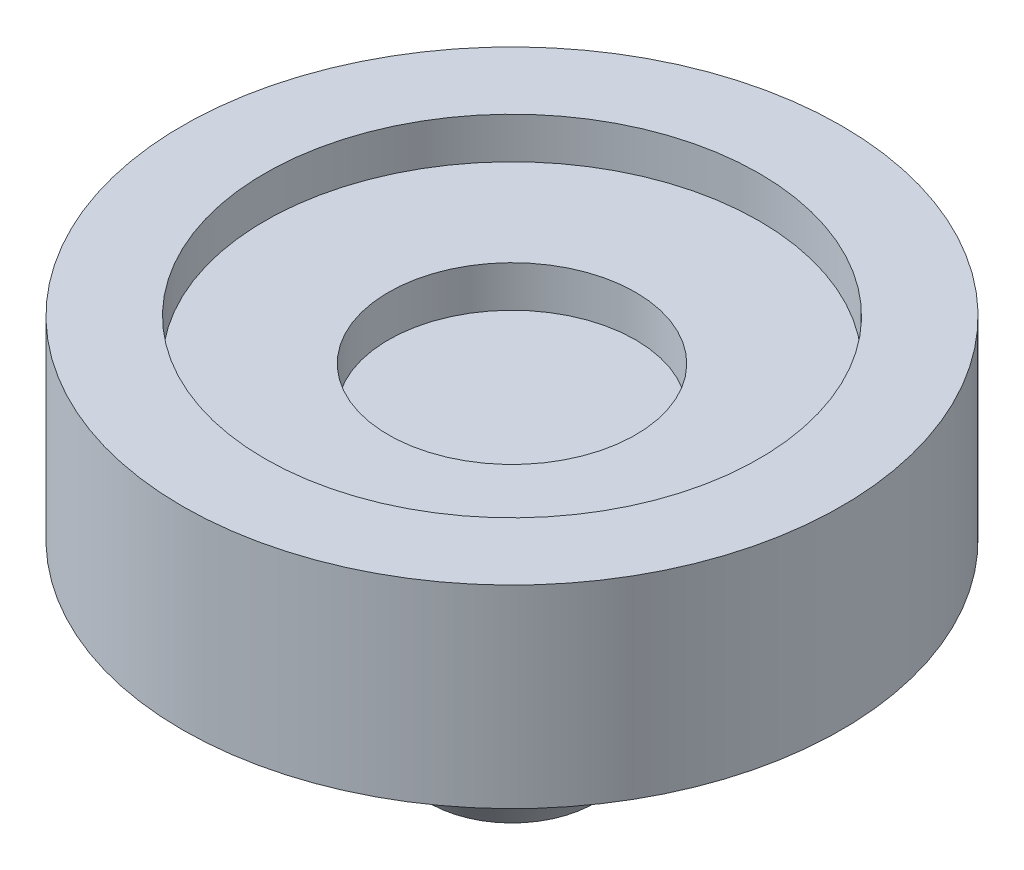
ISO-10303-21;
HEADER;
FILE_DESCRIPTION(('STEP AP214'),'2;1');
FILE_NAME('part.step','',(''),(''),'','','');
FILE_SCHEMA(('AUTOMOTIVE_DESIGN { 1 0 10303 214 1 1 1 1 }'));
ENDSEC;
DATA;
#1=APPLICATION_CONTEXT('core data for automotive mechanical design processes');
#2=APPLICATION_PROTOCOL_DEFINITION('international standard','automotive_design',2000,#1);
#3=PRODUCT_CONTEXT('',#1,'mechanical');
#4=PRODUCT('Part','Part','',(#3));
#5=PRODUCT_RELATED_PRODUCT_CATEGORY('part','',(#4));
#6=PRODUCT_DEFINITION_FORMATION('','',#4);
#7=PRODUCT_DEFINITION_CONTEXT('part definition',#1,'design');
#8=PRODUCT_DEFINITION('design','',#6,#7);
#9=PRODUCT_DEFINITION_SHAPE('','',#8);
#10=(LENGTH_UNIT() NAMED_UNIT(*) SI_UNIT(.MILLI.,.METRE.));
#11=(NAMED_UNIT(*) PLANE_ANGLE_UNIT() SI_UNIT($,.RADIAN.));
#12=(NAMED_UNIT(*) SI_UNIT($,.STERADIAN.) SOLID_ANGLE_UNIT());
#13=UNCERTAINTY_MEASURE_WITH_UNIT(LENGTH_MEASURE(1.E-05),#10,'distance_accuracy_value','');
#14=(GEOMETRIC_REPRESENTATION_CONTEXT(3) GLOBAL_UNCERTAINTY_ASSIGNED_CONTEXT((#13)) GLOBAL_UNIT_ASSIGNED_CONTEXT((#10,
#11,#12)) REPRESENTATION_CONTEXT('',''));
#15=CARTESIAN_POINT('',(0.,0.,0.));
#16=DIRECTION('',(0.,0.,1.));
#17=DIRECTION('',(1.,0.,0.));
#18=AXIS2_PLACEMENT_3D('',#15,#16,#17);
#19=CARTESIAN_POINT('',(0.,39.1918358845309,0.));
#20=DIRECTION('',(0.,-1.,0.));
#21=DIRECTION('',(-1.,0.,0.));
#22=AXIS2_PLACEMENT_3D('',#19,#20,#21);
#23=SPHERICAL_SURFACE('',#22,40.);
#24=CARTESIAN_POINT('',(0.,0.,0.));
#25=DIRECTION('',(0.,-1.,0.));
#26=DIRECTION('',(0.,0.,-1.));
#27=AXIS2_PLACEMENT_3D('',#24,#25,#26);
#28=CIRCLE('',#27,8.);
#29=CARTESIAN_POINT('',(-7.99999999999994,0.,0.));
#30=VERTEX_POINT('',#29);
#31=EDGE_CURVE('E10',#30,#30,#28,.T.);
#32=CARTESIAN_POINT('',(0.,4.55081973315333,0.));
#33=DIRECTION('',(0.,-1.,0.));
#34=DIRECTION('',(0.,0.,-1.));
#35=AXIS2_PLACEMENT_3D('',#32,#33,#34);
#36=CIRCLE('',#35,20.);
#37=CARTESIAN_POINT('',(-20.,4.55081973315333,0.));
#38=VERTEX_POINT('',#37);
#39=EDGE_CURVE('E70',#38,#38,#36,.T.);
#40=CARTESIAN_POINT('',(-7.99999999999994,0.,0.));
#41=CARTESIAN_POINT('',(-8.1315542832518,0.0268533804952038,0.));
#42=CARTESIAN_POINT('',(-8.26297334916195,0.0543691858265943,0.));
#43=CARTESIAN_POINT('',(-8.52552774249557,0.110722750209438,0.));
#44=CARTESIAN_POINT('',(-8.65666306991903,0.13956050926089,0.));
#45=CARTESIAN_POINT('',(-8.91863668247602,0.198555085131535,0.));
#46=CARTESIAN_POINT('',(-9.04947496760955,0.228711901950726,0.));
#47=CARTESIAN_POINT('',(-9.31084122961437,0.290341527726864,0.));
#48=CARTESIAN_POINT('',(-9.44136920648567,0.321814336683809,0.));
#49=CARTESIAN_POINT('',(-9.70210161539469,0.386072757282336,0.));
#50=CARTESIAN_POINT('',(-9.83230604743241,0.418858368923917,0.));
#51=CARTESIAN_POINT('',(-10.0923781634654,0.485739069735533,0.));
#52=CARTESIAN_POINT('',(-10.2222458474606,0.519834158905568,0.));
#53=CARTESIAN_POINT('',(-10.4816312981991,0.58933035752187,0.));
#54=CARTESIAN_POINT('',(-10.6111490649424,0.624731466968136,0.));
#55=CARTESIAN_POINT('',(-10.8698215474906,0.696836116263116,0.));
#56=CARTESIAN_POINT('',(-10.9989762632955,0.733539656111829,0.));
#57=CARTESIAN_POINT('',(-11.2569095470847,0.808245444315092,0.));
#58=CARTESIAN_POINT('',(-11.3856881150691,0.846247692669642,0.));
#59=CARTESIAN_POINT('',(-11.6428560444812,0.923547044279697,0.));
#60=CARTESIAN_POINT('',(-11.771245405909,0.962844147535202,0.));
#61=CARTESIAN_POINT('',(-12.0276219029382,1.04272922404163,0.));
#62=CARTESIAN_POINT('',(-12.1556090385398,1.08331719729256,0.));
#63=CARTESIAN_POINT('',(-12.4111681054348,1.1657798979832,0.));
#64=CARTESIAN_POINT('',(-12.5387400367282,1.20765462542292,0.));
#65=CARTESIAN_POINT('',(-12.7934557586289,1.292686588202,0.));
#66=CARTESIAN_POINT('',(-12.9205995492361,1.33584382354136,0.));
#67=CARTESIAN_POINT('',(-13.1744460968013,1.42343642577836,0.));
#68=CARTESIAN_POINT('',(-13.3011488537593,1.467871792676,0.));
#69=CARTESIAN_POINT('',(-13.5541004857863,1.55801615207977,0.));
#70=CARTESIAN_POINT('',(-13.6803493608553,1.6037251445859,0.));
#71=CARTESIAN_POINT('',(-13.9323804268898,1.69641212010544,0.));
#72=CARTESIAN_POINT('',(-14.0581626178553,1.74339010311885,0.));
#73=CARTESIAN_POINT('',(-14.3092475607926,1.83861029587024,0.));
#74=CARTESIAN_POINT('',(-14.4345503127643,1.88685250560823,0.));
#75=CARTESIAN_POINT('',(-14.684663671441,1.98459625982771,0.));
#76=CARTESIAN_POINT('',(-14.8094742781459,2.03409780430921,0.));
#77=CARTESIAN_POINT('',(-15.0585906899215,2.13435520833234,0.));
#78=CARTESIAN_POINT('',(-15.1828964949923,2.18511106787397,0.));
#79=CARTESIAN_POINT('',(-15.4309906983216,2.28787195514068,0.));
#80=CARTESIAN_POINT('',(-15.5547790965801,2.33987698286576,0.));
#81=CARTESIAN_POINT('',(-15.8018259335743,2.44513093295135,0.));
#82=CARTESIAN_POINT('',(-15.9250843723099,2.49837985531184,0.));
#83=CARTESIAN_POINT('',(-16.1710587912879,2.60611619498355,0.));
#84=CARTESIAN_POINT('',(-16.2937747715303,2.66060361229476,0.));
#85=CARTESIAN_POINT('',(-16.5386518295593,2.77081141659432,0.));
#86=CARTESIAN_POINT('',(-16.6608129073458,2.82653180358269,0.));
#87=CARTESIAN_POINT('',(-16.9045677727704,2.9391998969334,0.));
#88=CARTESIAN_POINT('',(-17.0261615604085,2.99614760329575,0.));
#89=CARTESIAN_POINT('',(-17.2687695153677,3.11126456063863,0.));
#90=CARTESIAN_POINT('',(-17.3897836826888,3.16943381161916,0.));
#91=CARTESIAN_POINT('',(-17.6312201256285,3.28698795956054,0.));
#92=CARTESIAN_POINT('',(-17.7516424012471,3.34637285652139,0.));
#93=CARTESIAN_POINT('',(-17.9918828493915,3.46635227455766,0.));
#94=CARTESIAN_POINT('',(-18.1117010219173,3.52694679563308,0.));
#95=CARTESIAN_POINT('',(-18.3507211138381,3.64933931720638,0.));
#96=CARTESIAN_POINT('',(-18.4699230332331,3.71113731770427,0.));
#97=CARTESIAN_POINT('',(-18.7076985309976,3.83593053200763,0.));
#98=CARTESIAN_POINT('',(-18.8262721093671,3.89892574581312,0.));
#99=CARTESIAN_POINT('',(-19.0627789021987,4.02610699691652,0.));
#100=CARTESIAN_POINT('',(-19.1807121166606,4.09029303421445,0.));
#101=CARTESIAN_POINT('',(-19.415926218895,4.21984943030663,0.));
#102=CARTESIAN_POINT('',(-19.5332071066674,4.28521978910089,0.));
#103=CARTESIAN_POINT('',(-19.7671046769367,4.41713817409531,0.));
#104=CARTESIAN_POINT('',(-19.8837213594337,4.48368620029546,0.));
#105=CARTESIAN_POINT('',(-20.,4.55081973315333,0.));
#106=B_SPLINE_CURVE_WITH_KNOTS('',3,(#40,#41,#42,#43,#44,#45,#46,#47,#48,#49,#50,#51,#52,#53,
#54,#55,#56,#57,#58,#59,#60,#61,#62,#63,#64,#65,#66,#67,#68,#69,#70,#71,#72,#73,#74,#75,#76,#77,
#78,#79,#80,#81,#82,#83,#84,#85,#86,#87,#88,#89,#90,#91,#92,#93,#94,#95,#96,#97,#98,#99,#100,
#101,#102,#103,#104,#105),.UNSPECIFIED.,.F.,.F.,(4,2,2,2,2,2,2,2,2,2,2,2,2,2,2,2,2,2,2,2,2,2,2,
2,2,2,2,2,2,2,2,2,4),(0.,0.40279936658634,0.805598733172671,1.20839809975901,1.61119746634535,
2.01399683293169,2.41679619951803,2.81959556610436,3.2223949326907,3.62519429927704,
4.02799366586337,4.43079303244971,4.83359239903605,5.23639176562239,5.63919113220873,
6.04199049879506,6.4447898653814,6.84758923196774,7.25038859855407,7.65318796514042,
8.05598733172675,8.45878669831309,8.86158606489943,9.26438543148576,9.6671847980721,
10.0699841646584,10.4727835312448,10.8755828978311,11.2783822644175,11.6811816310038,
12.0839809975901,12.4867803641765,12.8895797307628),.UNSPECIFIED.);
#107=EDGE_CURVE('BSEAM39',#30,#38,#106,.T.);
#108=ORIENTED_EDGE('',*,*,#31,.F.);
#109=ORIENTED_EDGE('',*,*,#39,.T.);
#110=ORIENTED_EDGE('',*,*,#107,.T.);
#111=ORIENTED_EDGE('',*,*,#107,.F.);
#112=EDGE_LOOP('',(#108,#110,#109,#111));
#113=FACE_BOUND('',#112,.T.);
#114=ADVANCED_FACE('F39',(#113),#23,.T.);
#115=CARTESIAN_POINT('',(-8.,0.,0.));
#116=DIRECTION('',(0.,1.,0.));
#117=DIRECTION('',(0.,0.,1.));
#118=AXIS2_PLACEMENT_3D('',#115,#116,#117);
#119=PLANE('',#118);
#120=ORIENTED_EDGE('',*,*,#31,.T.);
#121=EDGE_LOOP('',(#120));
#122=FACE_BOUND('',#121,.T.);
#123=ADVANCED_FACE('F118',(#122),#119,.F.);
#124=CARTESIAN_POINT('',(-30.,77.,0.));
#125=DIRECTION('',(0.,-1.,0.));
#126=DIRECTION('',(0.,0.,-1.));
#127=AXIS2_PLACEMENT_3D('',#124,#125,#126);
#128=PLANE('',#127);
#129=CARTESIAN_POINT('',(0.,77.,0.));
#130=DIRECTION('',(0.,-1.,0.));
#131=DIRECTION('',(0.,0.,-1.));
#132=AXIS2_PLACEMENT_3D('',#129,#130,#131);
#133=CIRCLE('',#132,30.);
#134=CARTESIAN_POINT('',(0.,77.,-30.));
#135=VERTEX_POINT('',#134);
#136=EDGE_CURVE('E45',#135,#135,#133,.T.);
#137=ORIENTED_EDGE('',*,*,#136,.F.);
#138=EDGE_LOOP('',(#137));
#139=FACE_BOUND('',#138,.T.);
#140=ADVANCED_FACE('F113',(#139),#128,.F.);
#141=CARTESIAN_POINT('',(0.,-213.825284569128,0.));
#142=DIRECTION('',(0.,-1.,0.));
#143=DIRECTION('',(0.,0.,-1.));
#144=AXIS2_PLACEMENT_3D('',#141,#142,#143);
#145=CYLINDRICAL_SURFACE('',#144,30.);
#146=CARTESIAN_POINT('',(0.,87.,0.));
#147=DIRECTION('',(0.,-1.,0.));
#148=DIRECTION('',(0.,0.,-1.));
#149=AXIS2_PLACEMENT_3D('',#146,#147,#148);
#150=CIRCLE('',#149,30.);
#151=CARTESIAN_POINT('',(0.,87.,-30.));
#152=VERTEX_POINT('',#151);
#153=EDGE_CURVE('E49',#152,#152,#150,.T.);
#154=ORIENTED_EDGE('',*,*,#153,.F.);
#155=EDGE_LOOP('',(#154));
#156=FACE_BOUND('',#155,.T.);
#157=ORIENTED_EDGE('',*,*,#136,.T.);
#158=EDGE_LOOP('',(#157));
#159=FACE_BOUND('',#158,.T.);
#160=ADVANCED_FACE('F108',(#156,#159),#145,.F.);
#161=CARTESIAN_POINT('',(-60.,87.,0.));
#162=DIRECTION('',(0.,-1.,0.));
#163=DIRECTION('',(0.,0.,-1.));
#164=AXIS2_PLACEMENT_3D('',#161,#162,#163);
#165=PLANE('',#164);
#166=CARTESIAN_POINT('',(0.,87.,0.));
#167=DIRECTION('',(0.,-1.,0.));
#168=DIRECTION('',(0.,0.,-1.));
#169=AXIS2_PLACEMENT_3D('',#166,#167,#168);
#170=CIRCLE('',#169,60.);
#171=CARTESIAN_POINT('',(0.,87.,-60.));
#172=VERTEX_POINT('',#171);
#173=EDGE_CURVE('E53',#172,#172,#170,.T.);
#174=ORIENTED_EDGE('',*,*,#173,.F.);
#175=EDGE_LOOP('',(#174));
#176=FACE_BOUND('',#175,.T.);
#177=ORIENTED_EDGE('',*,*,#153,.T.);
#178=EDGE_LOOP('',(#177));
#179=FACE_BOUND('',#178,.T.);
#180=ADVANCED_FACE('F102',(#176,#179),#165,.F.);
#181=CARTESIAN_POINT('',(0.,-213.825284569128,0.));
#182=DIRECTION('',(0.,-1.,0.));
#183=DIRECTION('',(0.,0.,-1.));
#184=AXIS2_PLACEMENT_3D('',#181,#182,#183);
#185=CYLINDRICAL_SURFACE('',#184,60.);
#186=CARTESIAN_POINT('',(0.,97.,0.));
#187=DIRECTION('',(0.,-1.,0.));
#188=DIRECTION('',(0.,0.,-1.));
#189=AXIS2_PLACEMENT_3D('',#186,#187,#188);
#190=CIRCLE('',#189,60.);
#191=CARTESIAN_POINT('',(0.,97.,-60.));
#192=VERTEX_POINT('',#191);
#193=EDGE_CURVE('E58',#192,#192,#190,.T.);
#194=ORIENTED_EDGE('',*,*,#193,.F.);
#195=EDGE_LOOP('',(#194));
#196=FACE_BOUND('',#195,.T.);
#197=ORIENTED_EDGE('',*,*,#173,.T.);
#198=EDGE_LOOP('',(#197));
#199=FACE_BOUND('',#198,.T.);
#200=ADVANCED_FACE('F96',(#196,#199),#185,.F.);
#201=CARTESIAN_POINT('',(-80.,97.,0.));
#202=DIRECTION('',(0.,-1.,0.));
#203=DIRECTION('',(0.,0.,-1.));
#204=AXIS2_PLACEMENT_3D('',#201,#202,#203);
#205=PLANE('',#204);
#206=CARTESIAN_POINT('',(0.,97.0000000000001,0.));
#207=DIRECTION('',(0.,-1.,0.));
#208=DIRECTION('',(0.,0.,-1.));
#209=AXIS2_PLACEMENT_3D('',#206,#207,#208);
#210=CIRCLE('',#209,80.);
#211=CARTESIAN_POINT('',(0.,97.0000000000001,-80.));
#212=VERTEX_POINT('',#211);
#213=EDGE_CURVE('E61',#212,#212,#210,.T.);
#214=ORIENTED_EDGE('',*,*,#213,.F.);
#215=EDGE_LOOP('',(#214));
#216=FACE_BOUND('',#215,.T.);
#217=ORIENTED_EDGE('',*,*,#193,.T.);
#218=EDGE_LOOP('',(#217));
#219=FACE_BOUND('',#218,.T.);
#220=ADVANCED_FACE('F90',(#216,#219),#205,.F.);
#221=CARTESIAN_POINT('',(0.,-213.825284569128,0.));
#222=DIRECTION('',(0.,-1.,0.));
#223=DIRECTION('',(0.,0.,-1.));
#224=AXIS2_PLACEMENT_3D('',#221,#222,#223);
#225=CYLINDRICAL_SURFACE('',#224,80.);
#226=CARTESIAN_POINT('',(0.,50.,0.));
#227=DIRECTION('',(0.,-1.,0.));
#228=DIRECTION('',(0.,0.,-1.));
#229=AXIS2_PLACEMENT_3D('',#226,#227,#228);
#230=CIRCLE('',#229,80.);
#231=CARTESIAN_POINT('',(0.,50.,-80.));
#232=VERTEX_POINT('',#231);
#233=EDGE_CURVE('E64',#232,#232,#230,.T.);
#234=ORIENTED_EDGE('',*,*,#233,.F.);
#235=EDGE_LOOP('',(#234));
#236=FACE_BOUND('',#235,.T.);
#237=ORIENTED_EDGE('',*,*,#213,.T.);
#238=EDGE_LOOP('',(#237));
#239=FACE_BOUND('',#238,.T.);
#240=ADVANCED_FACE('F84',(#236,#239),#225,.T.);
#241=CARTESIAN_POINT('',(-50.,50.,0.));
#242=DIRECTION('',(0.,1.,0.));
#243=DIRECTION('',(0.,0.,1.));
#244=AXIS2_PLACEMENT_3D('',#241,#242,#243);
#245=PLANE('',#244);
#246=CARTESIAN_POINT('',(0.,50.,0.));
#247=DIRECTION('',(0.,-1.,0.));
#248=DIRECTION('',(0.,0.,-1.));
#249=AXIS2_PLACEMENT_3D('',#246,#247,#248);
#250=CIRCLE('',#249,50.);
#251=CARTESIAN_POINT('',(0.,50.,-50.));
#252=VERTEX_POINT('',#251);
#253=EDGE_CURVE('E67',#252,#252,#250,.T.);
#254=ORIENTED_EDGE('',*,*,#253,.F.);
#255=EDGE_LOOP('',(#254));
#256=FACE_BOUND('',#255,.T.);
#257=ORIENTED_EDGE('',*,*,#233,.T.);
#258=EDGE_LOOP('',(#257));
#259=FACE_BOUND('',#258,.T.);
#260=ADVANCED_FACE('F78',(#256,#259),#245,.F.);
#261=CARTESIAN_POINT('',(0.,50.,0.));
#262=DIRECTION('',(0.,1.,0.));
#263=DIRECTION('',(0.,0.,1.));
#264=AXIS2_PLACEMENT_3D('',#261,#262,#263);
#265=CONICAL_SURFACE('',#264,50.,0.583427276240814);
#266=ORIENTED_EDGE('',*,*,#39,.F.);
#267=EDGE_LOOP('',(#266));
#268=FACE_BOUND('',#267,.T.);
#269=ORIENTED_EDGE('',*,*,#253,.T.);
#270=EDGE_LOOP('',(#269));
#271=FACE_BOUND('',#270,.T.);
#272=ADVANCED_FACE('F75',(#268,#271),#265,.T.);
#273=CLOSED_SHELL('',(#114,#123,#140,#160,#180,#200,#220,#240,#260,#272));
#274=MANIFOLD_SOLID_BREP('B2',#273);
#275=ADVANCED_BREP_SHAPE_REPRESENTATION('',(#18,#274),#14);
#276=SHAPE_DEFINITION_REPRESENTATION(#9,#275);
ENDSEC;
END-ISO-10303-21;
